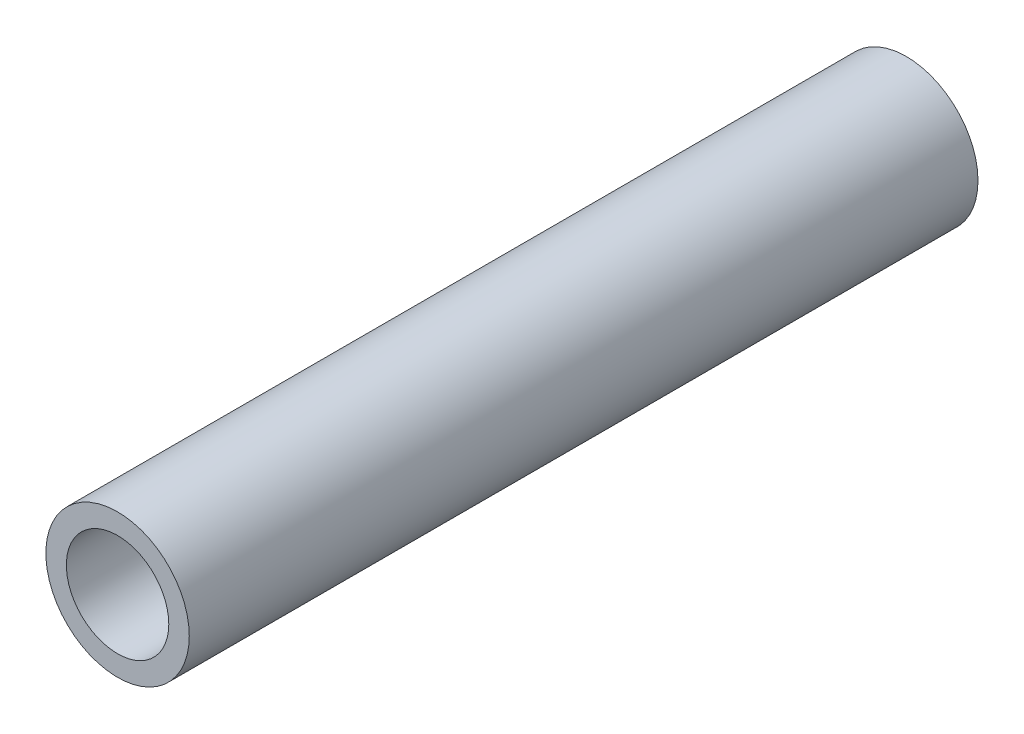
from build123d import *

# Parameters (mm, degrees)
ESQUISSE1_R      = 14
ESQUISSE1_R_2    = 10
EXTRUSION1_DEPTH = 154


with BuildPart() as part:
    # Esquisse1 → Extrusion1 (new body)
    with BuildSketch(Plane.XY):
        Circle(ESQUISSE1_R)
        Circle(ESQUISSE1_R_2, mode=Mode.SUBTRACT)
    extrude(amount=EXTRUSION1_DEPTH)


solid = part.part
